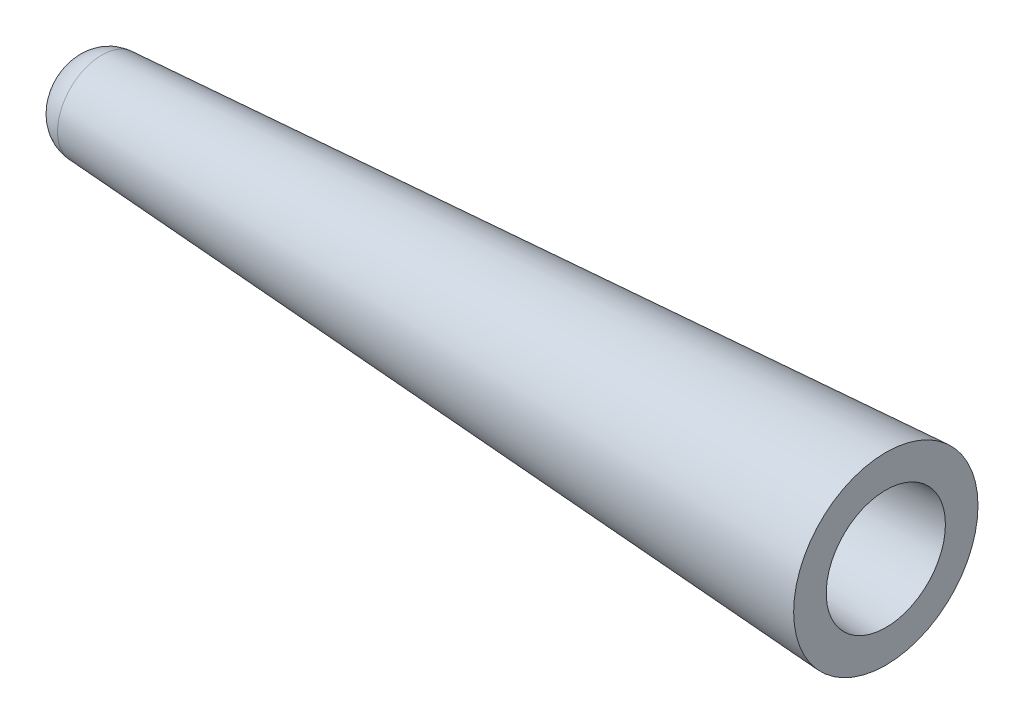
ISO-10303-21;
HEADER;
FILE_DESCRIPTION(('STEP AP214'),'2;1');
FILE_NAME('part.step','',(''),(''),'','','');
FILE_SCHEMA(('AUTOMOTIVE_DESIGN { 1 0 10303 214 1 1 1 1 }'));
ENDSEC;
DATA;
#1=APPLICATION_CONTEXT('core data for automotive mechanical design processes');
#2=APPLICATION_PROTOCOL_DEFINITION('international standard','automotive_design',2000,#1);
#3=PRODUCT_CONTEXT('',#1,'mechanical');
#4=PRODUCT('Part','Part','',(#3));
#5=PRODUCT_RELATED_PRODUCT_CATEGORY('part','',(#4));
#6=PRODUCT_DEFINITION_FORMATION('','',#4);
#7=PRODUCT_DEFINITION_CONTEXT('part definition',#1,'design');
#8=PRODUCT_DEFINITION('design','',#6,#7);
#9=PRODUCT_DEFINITION_SHAPE('','',#8);
#10=(LENGTH_UNIT() NAMED_UNIT(*) SI_UNIT(.MILLI.,.METRE.));
#11=(NAMED_UNIT(*) PLANE_ANGLE_UNIT() SI_UNIT($,.RADIAN.));
#12=(NAMED_UNIT(*) SI_UNIT($,.STERADIAN.) SOLID_ANGLE_UNIT());
#13=UNCERTAINTY_MEASURE_WITH_UNIT(LENGTH_MEASURE(1.E-05),#10,'distance_accuracy_value','');
#14=(GEOMETRIC_REPRESENTATION_CONTEXT(3) GLOBAL_UNCERTAINTY_ASSIGNED_CONTEXT((#13)) GLOBAL_UNIT_ASSIGNED_CONTEXT((#10,
#11,#12)) REPRESENTATION_CONTEXT('',''));
#15=CARTESIAN_POINT('',(0.,0.,0.));
#16=DIRECTION('',(0.,0.,1.));
#17=DIRECTION('',(1.,0.,0.));
#18=AXIS2_PLACEMENT_3D('',#15,#16,#17);
#19=CARTESIAN_POINT('',(1.99254615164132,0.,0.));
#20=DIRECTION('',(-1.,0.,0.));
#21=DIRECTION('',(0.,0.,1.));
#22=AXIS2_PLACEMENT_3D('',#19,#20,#21);
#23=DEGENERATE_TOROIDAL_SURFACE('',#22,0.721869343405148,1.99626959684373,.T.);
#24=CARTESIAN_POINT('',(0.,0.,0.));
#25=DIRECTION('',(-1.,0.,0.));
#26=DIRECTION('',(0.,0.,1.));
#27=AXIS2_PLACEMENT_3D('',#24,#25,#26);
#28=CIRCLE('',#27,0.6);
#29=CARTESIAN_POINT('',(0.,0.,-0.6));
#30=VERTEX_POINT('',#29);
#31=EDGE_CURVE('E53',#30,#30,#28,.T.);
#32=ORIENTED_EDGE('',*,*,#31,.F.);
#33=EDGE_LOOP('',(#32));
#34=FACE_BOUND('',#33,.T.);
#35=CARTESIAN_POINT('',(1.87067680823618,0.,0.));
#36=DIRECTION('',(-1.,0.,0.));
#37=DIRECTION('',(0.,0.,1.));
#38=AXIS2_PLACEMENT_3D('',#35,#36,#37);
#39=CIRCLE('',#38,2.71441549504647);
#40=CARTESIAN_POINT('',(1.87067680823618,0.,2.71441549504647));
#41=VERTEX_POINT('',#40);
#42=EDGE_CURVE('E11',#41,#41,#39,.T.);
#43=ORIENTED_EDGE('',*,*,#42,.T.);
#44=EDGE_LOOP('',(#43));
#45=FACE_BOUND('',#44,.T.);
#46=ADVANCED_FACE('F41',(#34,#45),#23,.T.);
#47=CARTESIAN_POINT('',(50.,0.,0.));
#48=DIRECTION('',(1.,0.,0.));
#49=DIRECTION('',(0.,0.,-1.));
#50=AXIS2_PLACEMENT_3D('',#47,#48,#49);
#51=CONICAL_SURFACE('',#50,5.65813100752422,0.0610865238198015);
#52=ORIENTED_EDGE('',*,*,#42,.F.);
#53=EDGE_LOOP('',(#52));
#54=FACE_BOUND('',#53,.T.);
#55=CARTESIAN_POINT('',(50.,0.,0.));
#56=DIRECTION('',(1.,0.,0.));
#57=DIRECTION('',(0.,0.,-1.));
#58=AXIS2_PLACEMENT_3D('',#55,#56,#57);
#59=CIRCLE('',#58,5.65813100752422);
#60=CARTESIAN_POINT('',(50.,0.,-5.65813100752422));
#61=VERTEX_POINT('',#60);
#62=EDGE_CURVE('E58',#61,#61,#59,.T.);
#63=ORIENTED_EDGE('',*,*,#62,.F.);
#64=EDGE_LOOP('',(#63));
#65=FACE_BOUND('',#64,.T.);
#66=ADVANCED_FACE('F67',(#54,#65),#51,.T.);
#67=CARTESIAN_POINT('',(0.,0.,0.));
#68=DIRECTION('',(1.,0.,0.));
#69=DIRECTION('',(0.,0.,-1.));
#70=AXIS2_PLACEMENT_3D('',#67,#68,#69);
#71=CONICAL_SURFACE('',#70,0.6,0.0610865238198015);
#72=CARTESIAN_POINT('',(50.,0.,0.));
#73=DIRECTION('',(-1.,0.,0.));
#74=DIRECTION('',(0.,0.,1.));
#75=AXIS2_PLACEMENT_3D('',#72,#73,#74);
#76=CIRCLE('',#75,3.65813100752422);
#77=CARTESIAN_POINT('',(50.,0.,-3.65813100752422));
#78=VERTEX_POINT('',#77);
#79=EDGE_CURVE('E48',#78,#78,#76,.T.);
#80=CARTESIAN_POINT('',(50.,0.,-3.65813100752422));
#81=CARTESIAN_POINT('',(49.4791666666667,0.,-3.62627547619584));
#82=CARTESIAN_POINT('',(48.9583333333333,0.,-3.59441994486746));
#83=CARTESIAN_POINT('',(47.9166666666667,0.,-3.53070888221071));
#84=CARTESIAN_POINT('',(47.3958333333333,0.,-3.49885335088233));
#85=CARTESIAN_POINT('',(46.3541666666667,0.,-3.43514228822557));
#86=CARTESIAN_POINT('',(45.8333333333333,0.,-3.4032867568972));
#87=CARTESIAN_POINT('',(44.7916666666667,0.,-3.33957569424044));
#88=CARTESIAN_POINT('',(44.2708333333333,0.,-3.30772016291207));
#89=CARTESIAN_POINT('',(43.2291666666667,0.,-3.24400910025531));
#90=CARTESIAN_POINT('',(42.7083333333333,0.,-3.21215356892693));
#91=CARTESIAN_POINT('',(41.6666666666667,0.,-3.14844250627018));
#92=CARTESIAN_POINT('',(41.1458333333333,0.,-3.1165869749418));
#93=CARTESIAN_POINT('',(40.1041666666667,0.,-3.05287591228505));
#94=CARTESIAN_POINT('',(39.5833333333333,0.,-3.02102038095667));
#95=CARTESIAN_POINT('',(38.5416666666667,0.,-2.95730931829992));
#96=CARTESIAN_POINT('',(38.0208333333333,0.,-2.92545378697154));
#97=CARTESIAN_POINT('',(36.9791666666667,0.,-2.86174272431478));
#98=CARTESIAN_POINT('',(36.4583333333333,0.,-2.82988719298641));
#99=CARTESIAN_POINT('',(35.4166666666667,0.,-2.76617613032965));
#100=CARTESIAN_POINT('',(34.8958333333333,0.,-2.73432059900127));
#101=CARTESIAN_POINT('',(33.8541666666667,0.,-2.67060953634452));
#102=CARTESIAN_POINT('',(33.3333333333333,0.,-2.63875400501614));
#103=CARTESIAN_POINT('',(32.2916666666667,0.,-2.57504294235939));
#104=CARTESIAN_POINT('',(31.7708333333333,0.,-2.54318741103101));
#105=CARTESIAN_POINT('',(30.7291666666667,0.,-2.47947634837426));
#106=CARTESIAN_POINT('',(30.2083333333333,0.,-2.44762081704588));
#107=CARTESIAN_POINT('',(29.1666666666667,0.,-2.38390975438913));
#108=CARTESIAN_POINT('',(28.6458333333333,0.,-2.35205422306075));
#109=CARTESIAN_POINT('',(27.6041666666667,0.,-2.28834316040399));
#110=CARTESIAN_POINT('',(27.0833333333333,0.,-2.25648762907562));
#111=CARTESIAN_POINT('',(26.0416666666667,0.,-2.19277656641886));
#112=CARTESIAN_POINT('',(25.5208333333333,0.,-2.16092103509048));
#113=CARTESIAN_POINT('',(24.4791666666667,0.,-2.09720997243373));
#114=CARTESIAN_POINT('',(23.9583333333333,0.,-2.06535444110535));
#115=CARTESIAN_POINT('',(22.9166666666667,0.,-2.0016433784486));
#116=CARTESIAN_POINT('',(22.3958333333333,0.,-1.96978784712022));
#117=CARTESIAN_POINT('',(21.3541666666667,0.,-1.90607678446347));
#118=CARTESIAN_POINT('',(20.8333333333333,0.,-1.87422125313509));
#119=CARTESIAN_POINT('',(19.7916666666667,0.,-1.81051019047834));
#120=CARTESIAN_POINT('',(19.2708333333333,0.,-1.77865465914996));
#121=CARTESIAN_POINT('',(18.2291666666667,0.,-1.7149435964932));
#122=CARTESIAN_POINT('',(17.7083333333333,0.,-1.68308806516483));
#123=CARTESIAN_POINT('',(16.6666666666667,0.,-1.61937700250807));
#124=CARTESIAN_POINT('',(16.1458333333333,0.,-1.58752147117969));
#125=CARTESIAN_POINT('',(15.1041666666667,0.,-1.52381040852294));
#126=CARTESIAN_POINT('',(14.5833333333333,0.,-1.49195487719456));
#127=CARTESIAN_POINT('',(13.5416666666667,0.,-1.42824381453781));
#128=CARTESIAN_POINT('',(13.0208333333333,0.,-1.39638828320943));
#129=CARTESIAN_POINT('',(11.9791666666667,0.,-1.33267722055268));
#130=CARTESIAN_POINT('',(11.4583333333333,0.,-1.3008216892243));
#131=CARTESIAN_POINT('',(10.4166666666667,0.,-1.23711062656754));
#132=CARTESIAN_POINT('',(9.89583333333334,0.,-1.20525509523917));
#133=CARTESIAN_POINT('',(8.85416666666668,0.,-1.14154403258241));
#134=CARTESIAN_POINT('',(8.33333333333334,0.,-1.10968850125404));
#135=CARTESIAN_POINT('',(7.29166666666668,0.,-1.04597743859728));
#136=CARTESIAN_POINT('',(6.77083333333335,0.,-1.0141219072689));
#137=CARTESIAN_POINT('',(5.72916666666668,0.,-0.95041084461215));
#138=CARTESIAN_POINT('',(5.20833333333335,0.,-0.918555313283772));
#139=CARTESIAN_POINT('',(4.16666666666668,0.,-0.854844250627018));
#140=CARTESIAN_POINT('',(3.64583333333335,0.,-0.822988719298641));
#141=CARTESIAN_POINT('',(2.60416666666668,0.,-0.759277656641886));
#142=CARTESIAN_POINT('',(2.08333333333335,0.,-0.727422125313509));
#143=CARTESIAN_POINT('',(1.04166666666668,0.,-0.663711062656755));
#144=CARTESIAN_POINT('',(0.520833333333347,0.,-0.631855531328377));
#145=CARTESIAN_POINT('',(0.,0.,-0.6));
#146=B_SPLINE_CURVE_WITH_KNOTS('',3,(#80,#81,#82,#83,#84,#85,#86,#87,#88,#89,#90,#91,#92,#93,
#94,#95,#96,#97,#98,#99,#100,#101,#102,#103,#104,#105,#106,#107,#108,#109,#110,#111,#112,#113,
#114,#115,#116,#117,#118,#119,#120,#121,#122,#123,#124,#125,#126,#127,#128,#129,#130,#131,#132,
#133,#134,#135,#136,#137,#138,#139,#140,#141,#142,#143,#144,#145),.UNSPECIFIED.,.F.,.F.,(4,2,2,
2,2,2,2,2,2,2,2,2,2,2,2,2,2,2,2,2,2,2,2,2,2,2,2,2,2,2,2,2,4),(0.,1.56541982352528,
3.13083964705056,4.69625947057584,6.26167929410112,7.8270991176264,9.39251894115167,
10.957938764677,12.5233585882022,14.0887784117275,15.6541982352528,17.2196180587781,
18.7850378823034,20.3504577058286,21.9158775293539,23.4812973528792,25.0467171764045,
26.6121369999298,28.177556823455,29.7429766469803,31.3083964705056,32.8738162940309,
34.4392361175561,36.0046559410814,37.5700757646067,39.135495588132,40.7009154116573,
42.2663352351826,43.8317550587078,45.3971748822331,46.9625947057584,48.5280145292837,
50.0934343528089),.UNSPECIFIED.);
#147=EDGE_CURVE('BSEAM69',#78,#30,#146,.T.);
#148=ORIENTED_EDGE('',*,*,#79,.F.);
#149=ORIENTED_EDGE('',*,*,#31,.T.);
#150=ORIENTED_EDGE('',*,*,#147,.T.);
#151=ORIENTED_EDGE('',*,*,#147,.F.);
#152=EDGE_LOOP('',(#148,#150,#149,#151));
#153=FACE_BOUND('',#152,.T.);
#154=ADVANCED_FACE('F69',(#153),#71,.F.);
#155=CARTESIAN_POINT('',(50.,0.,0.));
#156=DIRECTION('',(1.,0.,0.));
#157=DIRECTION('',(0.,0.,-1.));
#158=AXIS2_PLACEMENT_3D('',#155,#156,#157);
#159=PLANE('',#158);
#160=ORIENTED_EDGE('',*,*,#62,.T.);
#161=EDGE_LOOP('',(#160));
#162=FACE_BOUND('',#161,.T.);
#163=ORIENTED_EDGE('',*,*,#79,.T.);
#164=EDGE_LOOP('',(#163));
#165=FACE_BOUND('',#164,.T.);
#166=ADVANCED_FACE('F65',(#162,#165),#159,.T.);
#167=CLOSED_SHELL('',(#46,#66,#154,#166));
#168=MANIFOLD_SOLID_BREP('B2',#167);
#169=ADVANCED_BREP_SHAPE_REPRESENTATION('',(#18,#168),#14);
#170=SHAPE_DEFINITION_REPRESENTATION(#9,#169);
ENDSEC;
END-ISO-10303-21;
